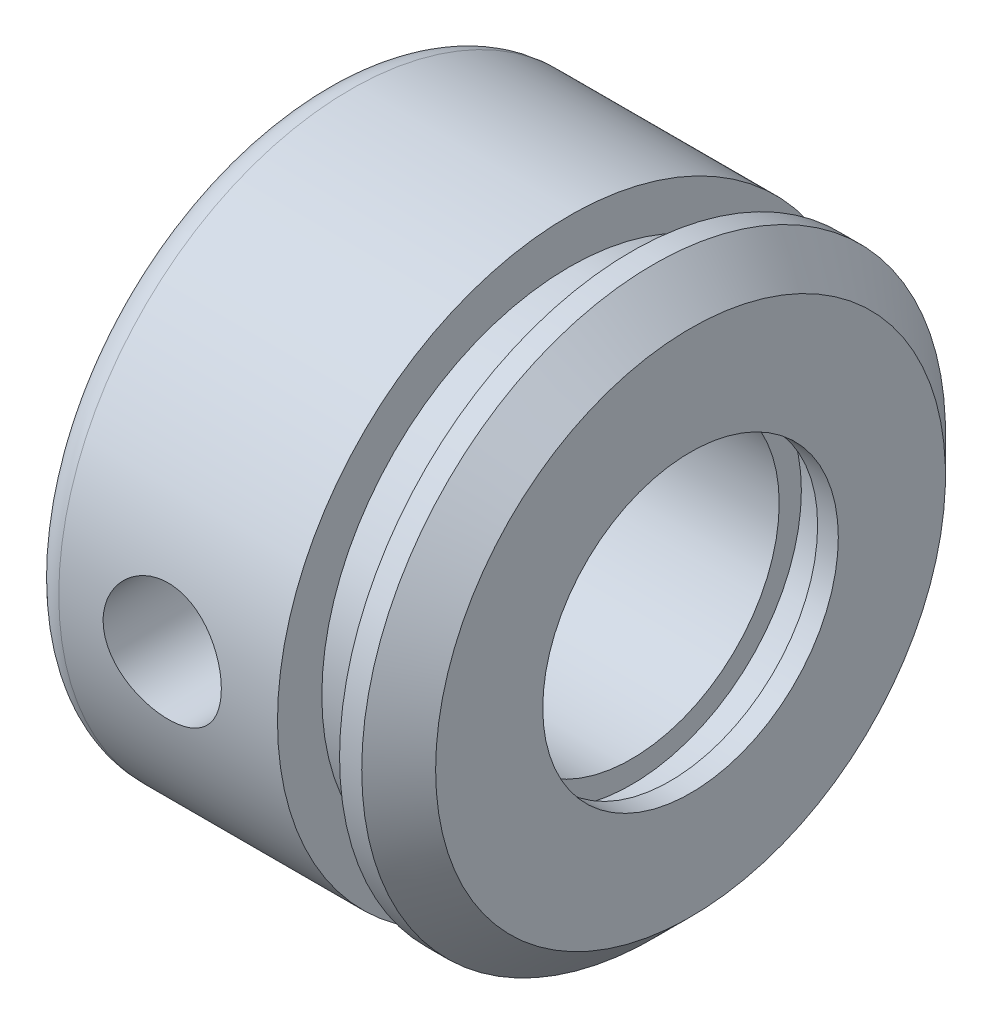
from build123d import *

# Parameters (mm, degrees)
ENL_V_MAT_EXTRU_1_DEPTH      = 37.825602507
ENL_V_MAT_EXTRU_1_DEPTH_BACK = 37.825602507
ESQUISSE2_R                  = 4
CONG_2_R                     = 2


with BuildPart() as part:
    # Esquisse1 → Base-R_volution (revolve)
    with BuildSketch(Plane.XY, mode=Mode.PRIVATE) as base_r_volution_sk:
        Polygon((-24, 10), (-24, 19.75), (-7.2, 19.75), (-7.2, 16.75), (-3, 16.75), (-3, 19.75), (-1.5, 19.75), (1, 17.25), (1, 10), (-0.4, 10), (-0.4, 11.5), (-3, 11.5), (-3, 10), align=None)
    revolve(base_r_volution_sk.sketch.rotate(Axis((-92, 0, 0), (1, 0, 0)), 90), axis=Axis((-92, 0, 0), (1, 0, 0)))

    # Esquisse2 → Enl_v. mat.-Extru.1 (cut, two sides: drawn at the far end of the back side and taken through both)
    with BuildSketch(Plane.XY.offset(-ENL_V_MAT_EXTRU_1_DEPTH_BACK)):
        with Locations((-15, 0)):
            Circle(ESQUISSE2_R)
    extrude(amount=ENL_V_MAT_EXTRU_1_DEPTH + ENL_V_MAT_EXTRU_1_DEPTH_BACK, mode=Mode.SUBTRACT)

    # Cong_2
    cong_2_edges = [part.edges().sort_by_distance(p)[0] for p in [
        (-24, 0, -19.75),
    ]]
    fillet(cong_2_edges, radius=CONG_2_R)


solid = part.part
